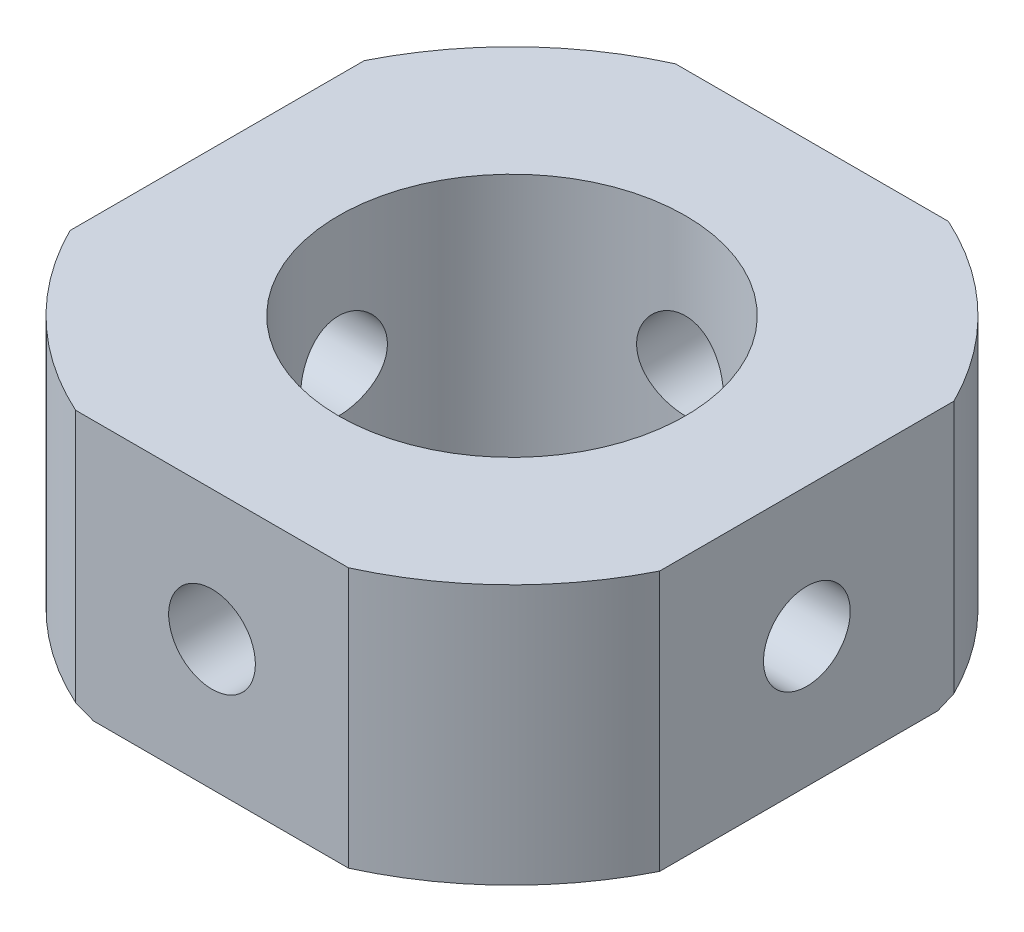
ISO-10303-21;
HEADER;
FILE_DESCRIPTION(('STEP AP214'),'2;1');
FILE_NAME('part.step','',(''),(''),'','','');
FILE_SCHEMA(('AUTOMOTIVE_DESIGN { 1 0 10303 214 1 1 1 1 }'));
ENDSEC;
DATA;
#1=APPLICATION_CONTEXT('core data for automotive mechanical design processes');
#2=APPLICATION_PROTOCOL_DEFINITION('international standard','automotive_design',2000,#1);
#3=PRODUCT_CONTEXT('',#1,'mechanical');
#4=PRODUCT('Part','Part','',(#3));
#5=PRODUCT_RELATED_PRODUCT_CATEGORY('part','',(#4));
#6=PRODUCT_DEFINITION_FORMATION('','',#4);
#7=PRODUCT_DEFINITION_CONTEXT('part definition',#1,'design');
#8=PRODUCT_DEFINITION('design','',#6,#7);
#9=PRODUCT_DEFINITION_SHAPE('','',#8);
#10=(LENGTH_UNIT() NAMED_UNIT(*) SI_UNIT(.MILLI.,.METRE.));
#11=(NAMED_UNIT(*) PLANE_ANGLE_UNIT() SI_UNIT($,.RADIAN.));
#12=(NAMED_UNIT(*) SI_UNIT($,.STERADIAN.) SOLID_ANGLE_UNIT());
#13=UNCERTAINTY_MEASURE_WITH_UNIT(LENGTH_MEASURE(1.E-05),#10,'distance_accuracy_value','');
#14=(GEOMETRIC_REPRESENTATION_CONTEXT(3) GLOBAL_UNCERTAINTY_ASSIGNED_CONTEXT((#13)) GLOBAL_UNIT_ASSIGNED_CONTEXT((#10,
#11,#12)) REPRESENTATION_CONTEXT('',''));
#15=CARTESIAN_POINT('',(0.,0.,0.));
#16=DIRECTION('',(0.,0.,1.));
#17=DIRECTION('',(1.,0.,0.));
#18=AXIS2_PLACEMENT_3D('',#15,#16,#17);
#19=CARTESIAN_POINT('',(-8.5,-3.75,-8.64766599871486));
#20=DIRECTION('',(0.,0.,-1.));
#21=DIRECTION('',(-1.,0.,0.));
#22=AXIS2_PLACEMENT_3D('',#19,#20,#21);
#23=PLANE('',#22);
#24=DIRECTION('',(0.,-1.,0.));
#25=VECTOR('',#24,1.);
#26=CARTESIAN_POINT('',(3.93292165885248,3.75,-8.64766599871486));
#27=LINE('',#26,#25);
#28=CARTESIAN_POINT('',(3.93292165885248,3.75,-8.64766599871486));
#29=VERTEX_POINT('',#28);
#30=CARTESIAN_POINT('',(3.93292165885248,-3.55,-8.64766599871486));
#31=VERTEX_POINT('',#30);
#32=EDGE_CURVE('E125',#29,#31,#27,.T.);
#33=ORIENTED_EDGE('',*,*,#32,.T.);
#34=CARTESIAN_POINT('',(3.93292165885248,-3.55,-8.64766599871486));
#35=CARTESIAN_POINT('',(3.84838019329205,-3.58503549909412,-8.64766599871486));
#36=CARTESIAN_POINT('',(3.76350577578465,-3.61921989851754,-8.64766599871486));
#37=CARTESIAN_POINT('',(3.59309085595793,-3.68588656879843,-8.64766599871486));
#38=CARTESIAN_POINT('',(3.50755035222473,-3.71836883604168,-8.64766599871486));
#39=CARTESIAN_POINT('',(3.42167689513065,-3.75,-8.64766599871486));
#40=B_SPLINE_CURVE_WITH_KNOTS('',3,(#34,#35,#36,#37,#38,#39),.UNSPECIFIED.,.F.,.F.,(4,2,4),(0.,
0.27449983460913,0.549000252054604),.UNSPECIFIED.);
#41=CARTESIAN_POINT('',(3.42167689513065,-3.75,-8.64766599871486));
#42=VERTEX_POINT('',#41);
#43=EDGE_CURVE('E280',#31,#42,#40,.T.);
#44=ORIENTED_EDGE('',*,*,#43,.T.);
#45=DIRECTION('',(-1.,0.,0.));
#46=VECTOR('',#45,1.);
#47=CARTESIAN_POINT('',(0.,-3.75,-8.64766599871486));
#48=LINE('',#47,#46);
#49=CARTESIAN_POINT('',(-3.93292165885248,-3.75,-8.64766599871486));
#50=VERTEX_POINT('',#49);
#51=EDGE_CURVE('E151',#42,#50,#48,.T.);
#52=ORIENTED_EDGE('',*,*,#51,.T.);
#53=DIRECTION('',(0.,-1.,0.));
#54=VECTOR('',#53,1.);
#55=CARTESIAN_POINT('',(-3.93292165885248,3.75,-8.64766599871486));
#56=LINE('',#55,#54);
#57=CARTESIAN_POINT('',(-3.93292165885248,3.75,-8.64766599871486));
#58=VERTEX_POINT('',#57);
#59=EDGE_CURVE('E127',#50,#58,#56,.F.);
#60=ORIENTED_EDGE('',*,*,#59,.T.);
#61=DIRECTION('',(-1.,0.,0.));
#62=VECTOR('',#61,1.);
#63=CARTESIAN_POINT('',(-8.5,3.75,-8.64766599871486));
#64=LINE('',#63,#62);
#65=EDGE_CURVE('E122',#29,#58,#64,.T.);
#66=ORIENTED_EDGE('',*,*,#65,.F.);
#67=EDGE_LOOP('',(#33,#44,#52,#60,#66));
#68=FACE_BOUND('',#67,.T.);
#69=CARTESIAN_POINT('',(0.,0.,-8.64766599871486));
#70=DIRECTION('',(0.,0.,1.));
#71=DIRECTION('',(1.,0.,0.));
#72=AXIS2_PLACEMENT_3D('',#69,#70,#71);
#73=CIRCLE('',#72,1.25);
#74=CARTESIAN_POINT('',(1.25,0.,-8.64766599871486));
#75=VERTEX_POINT('',#74);
#76=EDGE_CURVE('E217',#75,#75,#73,.T.);
#77=ORIENTED_EDGE('',*,*,#76,.T.);
#78=EDGE_LOOP('',(#77));
#79=FACE_BOUND('',#78,.T.);
#80=ADVANCED_FACE('F39',(#68,#79),#23,.T.);
#81=CARTESIAN_POINT('',(0.,3.75,0.));
#82=DIRECTION('',(0.,-1.,0.));
#83=DIRECTION('',(0.,0.,-1.));
#84=AXIS2_PLACEMENT_3D('',#81,#82,#83);
#85=CYLINDRICAL_SURFACE('',#84,9.5);
#86=DIRECTION('',(0.,-1.,0.));
#87=VECTOR('',#86,1.);
#88=CARTESIAN_POINT('',(8.5,3.75,4.24264068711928));
#89=LINE('',#88,#87);
#90=CARTESIAN_POINT('',(8.5,3.75,4.24264068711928));
#91=VERTEX_POINT('',#90);
#92=CARTESIAN_POINT('',(8.5,-3.75,4.24264068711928));
#93=VERTEX_POINT('',#92);
#94=EDGE_CURVE('E250',#91,#93,#89,.T.);
#95=ORIENTED_EDGE('',*,*,#94,.F.);
#96=CARTESIAN_POINT('',(0.,3.75,0.));
#97=DIRECTION('',(0.,1.,0.));
#98=DIRECTION('',(0.,0.,1.));
#99=AXIS2_PLACEMENT_3D('',#96,#97,#98);
#100=CIRCLE('',#99,9.5);
#101=CARTESIAN_POINT('',(3.93292165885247,3.75,8.64766599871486));
#102=VERTEX_POINT('',#101);
#103=EDGE_CURVE('E148',#102,#91,#100,.T.);
#104=ORIENTED_EDGE('',*,*,#103,.F.);
#105=DIRECTION('',(0.,-1.,0.));
#106=VECTOR('',#105,1.);
#107=CARTESIAN_POINT('',(3.93292165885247,3.75,8.64766599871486));
#108=LINE('',#107,#106);
#109=CARTESIAN_POINT('',(3.93292165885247,-3.75,8.64766599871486));
#110=VERTEX_POINT('',#109);
#111=EDGE_CURVE('E243',#110,#102,#108,.F.);
#112=ORIENTED_EDGE('',*,*,#111,.F.);
#113=CARTESIAN_POINT('',(0.,-3.75,0.));
#114=DIRECTION('',(0.,1.,0.));
#115=DIRECTION('',(0.,0.,1.));
#116=AXIS2_PLACEMENT_3D('',#113,#114,#115);
#117=CIRCLE('',#116,9.5);
#118=EDGE_CURVE('E157',#110,#93,#117,.T.);
#119=ORIENTED_EDGE('',*,*,#118,.T.);
#120=EDGE_LOOP('',(#95,#104,#112,#119));
#121=FACE_BOUND('',#120,.T.);
#122=ADVANCED_FACE('F271',(#121),#85,.T.);
#123=DIRECTION('',(0.,-1.,0.));
#124=VECTOR('',#123,1.);
#125=CARTESIAN_POINT('',(8.5,3.75,-4.24264068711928));
#126=LINE('',#125,#124);
#127=CARTESIAN_POINT('',(8.5,-3.55,-4.24264068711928));
#128=VERTEX_POINT('',#127);
#129=CARTESIAN_POINT('',(8.5,3.75,-4.24264068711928));
#130=VERTEX_POINT('',#129);
#131=EDGE_CURVE('E248',#128,#130,#126,.F.);
#132=ORIENTED_EDGE('',*,*,#131,.F.);
#133=CARTESIAN_POINT('',(0.,-3.55,0.));
#134=DIRECTION('',(0.,1.,0.));
#135=DIRECTION('',(0.,0.,1.));
#136=AXIS2_PLACEMENT_3D('',#133,#134,#135);
#137=CIRCLE('',#136,9.5);
#138=EDGE_CURVE('E142',#128,#31,#137,.T.);
#139=ORIENTED_EDGE('',*,*,#138,.T.);
#140=ORIENTED_EDGE('',*,*,#32,.F.);
#141=EDGE_CURVE('E140',#130,#29,#100,.T.);
#142=ORIENTED_EDGE('',*,*,#141,.F.);
#143=EDGE_LOOP('',(#132,#139,#140,#142));
#144=FACE_BOUND('',#143,.T.);
#145=ADVANCED_FACE('F139',(#144),#85,.T.);
#146=DIRECTION('',(0.,-1.,0.));
#147=VECTOR('',#146,1.);
#148=CARTESIAN_POINT('',(-8.5,3.75,4.24264068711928));
#149=LINE('',#148,#147);
#150=CARTESIAN_POINT('',(-8.5,-3.55,4.24264068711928));
#151=VERTEX_POINT('',#150);
#152=CARTESIAN_POINT('',(-8.5,3.75,4.24264068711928));
#153=VERTEX_POINT('',#152);
#154=EDGE_CURVE('E143',#151,#153,#149,.F.);
#155=ORIENTED_EDGE('',*,*,#154,.F.);
#156=CARTESIAN_POINT('',(0.,-3.55,0.));
#157=DIRECTION('',(0.,1.,0.));
#158=DIRECTION('',(0.,0.,1.));
#159=AXIS2_PLACEMENT_3D('',#156,#157,#158);
#160=CIRCLE('',#159,9.5);
#161=CARTESIAN_POINT('',(-3.93292165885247,-3.55,8.64766599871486));
#162=VERTEX_POINT('',#161);
#163=EDGE_CURVE('E208',#151,#162,#160,.T.);
#164=ORIENTED_EDGE('',*,*,#163,.T.);
#165=DIRECTION('',(0.,-1.,0.));
#166=VECTOR('',#165,1.);
#167=CARTESIAN_POINT('',(-3.93292165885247,3.75,8.64766599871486));
#168=LINE('',#167,#166);
#169=CARTESIAN_POINT('',(-3.93292165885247,3.75,8.64766599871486));
#170=VERTEX_POINT('',#169);
#171=EDGE_CURVE('E245',#170,#162,#168,.T.);
#172=ORIENTED_EDGE('',*,*,#171,.F.);
#173=EDGE_CURVE('E152',#153,#170,#100,.T.);
#174=ORIENTED_EDGE('',*,*,#173,.F.);
#175=EDGE_LOOP('',(#155,#164,#172,#174));
#176=FACE_BOUND('',#175,.T.);
#177=ADVANCED_FACE('F268',(#176),#85,.T.);
#178=DIRECTION('',(0.,-1.,0.));
#179=VECTOR('',#178,1.);
#180=CARTESIAN_POINT('',(-8.5,3.75,-4.24264068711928));
#181=LINE('',#180,#179);
#182=CARTESIAN_POINT('',(-8.5,3.75,-4.24264068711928));
#183=VERTEX_POINT('',#182);
#184=CARTESIAN_POINT('',(-8.5,-3.75,-4.24264068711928));
#185=VERTEX_POINT('',#184);
#186=EDGE_CURVE('E241',#183,#185,#181,.T.);
#187=ORIENTED_EDGE('',*,*,#186,.F.);
#188=EDGE_CURVE('E149',#58,#183,#100,.T.);
#189=ORIENTED_EDGE('',*,*,#188,.F.);
#190=ORIENTED_EDGE('',*,*,#59,.F.);
#191=EDGE_CURVE('E160',#50,#185,#117,.T.);
#192=ORIENTED_EDGE('',*,*,#191,.T.);
#193=EDGE_LOOP('',(#187,#189,#190,#192));
#194=FACE_BOUND('',#193,.T.);
#195=ADVANCED_FACE('F262',(#194),#85,.T.);
#196=CARTESIAN_POINT('',(0.,3.75,0.));
#197=DIRECTION('',(0.,1.,0.));
#198=DIRECTION('',(0.,0.,1.));
#199=AXIS2_PLACEMENT_3D('',#196,#197,#198);
#200=PLANE('',#199);
#201=CARTESIAN_POINT('',(0.,3.75,0.));
#202=DIRECTION('',(0.,1.,0.));
#203=DIRECTION('',(0.,0.,1.));
#204=AXIS2_PLACEMENT_3D('',#201,#202,#203);
#205=CIRCLE('',#204,5.);
#206=CARTESIAN_POINT('',(0.,3.75,5.));
#207=VERTEX_POINT('',#206);
#208=EDGE_CURVE('E155',#207,#207,#205,.T.);
#209=ORIENTED_EDGE('',*,*,#208,.F.);
#210=EDGE_LOOP('',(#209));
#211=FACE_BOUND('',#210,.T.);
#212=ORIENTED_EDGE('',*,*,#103,.T.);
#213=DIRECTION('',(0.,0.,-1.));
#214=VECTOR('',#213,1.);
#215=CARTESIAN_POINT('',(8.5,3.75,8.64766599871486));
#216=LINE('',#215,#214);
#217=EDGE_CURVE('E133',#91,#130,#216,.T.);
#218=ORIENTED_EDGE('',*,*,#217,.T.);
#219=ORIENTED_EDGE('',*,*,#141,.T.);
#220=ORIENTED_EDGE('',*,*,#65,.T.);
#221=ORIENTED_EDGE('',*,*,#188,.T.);
#222=DIRECTION('',(0.,0.,1.));
#223=VECTOR('',#222,1.);
#224=CARTESIAN_POINT('',(-8.5,3.75,8.64766599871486));
#225=LINE('',#224,#223);
#226=EDGE_CURVE('E132',#183,#153,#225,.T.);
#227=ORIENTED_EDGE('',*,*,#226,.T.);
#228=ORIENTED_EDGE('',*,*,#173,.T.);
#229=DIRECTION('',(1.,0.,0.));
#230=VECTOR('',#229,1.);
#231=CARTESIAN_POINT('',(-8.5,3.75,8.64766599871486));
#232=LINE('',#231,#230);
#233=EDGE_CURVE('E236',#170,#102,#232,.T.);
#234=ORIENTED_EDGE('',*,*,#233,.T.);
#235=EDGE_LOOP('',(#212,#218,#219,#220,#221,#227,#228,#234));
#236=FACE_BOUND('',#235,.T.);
#237=ADVANCED_FACE('F147',(#211,#236),#200,.T.);
#238=CARTESIAN_POINT('',(0.,-3.75,0.));
#239=DIRECTION('',(0.,1.,0.));
#240=DIRECTION('',(0.,0.,1.));
#241=AXIS2_PLACEMENT_3D('',#238,#239,#240);
#242=PLANE('',#241);
#243=CARTESIAN_POINT('',(0.,-3.75,0.));
#244=DIRECTION('',(0.,1.,0.));
#245=DIRECTION('',(0.,0.,1.));
#246=AXIS2_PLACEMENT_3D('',#243,#244,#245);
#247=CIRCLE('',#246,5.);
#248=CARTESIAN_POINT('',(0.,-3.75,5.));
#249=VERTEX_POINT('',#248);
#250=EDGE_CURVE('E251',#249,#249,#247,.T.);
#251=ORIENTED_EDGE('',*,*,#250,.T.);
#252=EDGE_LOOP('',(#251));
#253=FACE_BOUND('',#252,.T.);
#254=ORIENTED_EDGE('',*,*,#51,.F.);
#255=CARTESIAN_POINT('',(0.,-3.75,0.));
#256=DIRECTION('',(0.,1.,0.));
#257=DIRECTION('',(0.,0.,1.));
#258=AXIS2_PLACEMENT_3D('',#255,#256,#257);
#259=CIRCLE('',#258,9.3);
#260=CARTESIAN_POINT('',(8.5,-3.75,-3.77359245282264));
#261=VERTEX_POINT('',#260);
#262=EDGE_CURVE('E295',#42,#261,#259,.F.);
#263=ORIENTED_EDGE('',*,*,#262,.T.);
#264=DIRECTION('',(0.,0.,-1.));
#265=VECTOR('',#264,1.);
#266=CARTESIAN_POINT('',(8.5,-3.75,0.));
#267=LINE('',#266,#265);
#268=EDGE_CURVE('E166',#93,#261,#267,.T.);
#269=ORIENTED_EDGE('',*,*,#268,.F.);
#270=ORIENTED_EDGE('',*,*,#118,.F.);
#271=DIRECTION('',(1.,0.,0.));
#272=VECTOR('',#271,1.);
#273=CARTESIAN_POINT('',(0.,-3.75,8.64766599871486));
#274=LINE('',#273,#272);
#275=CARTESIAN_POINT('',(-3.42167689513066,-3.75,8.64766599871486));
#276=VERTEX_POINT('',#275);
#277=EDGE_CURVE('E164',#276,#110,#274,.T.);
#278=ORIENTED_EDGE('',*,*,#277,.F.);
#279=CARTESIAN_POINT('',(0.,-3.75,0.));
#280=DIRECTION('',(0.,1.,0.));
#281=DIRECTION('',(0.,0.,1.));
#282=AXIS2_PLACEMENT_3D('',#279,#280,#281);
#283=CIRCLE('',#282,9.3);
#284=CARTESIAN_POINT('',(-8.5,-3.75,3.77359245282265));
#285=VERTEX_POINT('',#284);
#286=EDGE_CURVE('E285',#276,#285,#283,.F.);
#287=ORIENTED_EDGE('',*,*,#286,.T.);
#288=DIRECTION('',(0.,0.,1.));
#289=VECTOR('',#288,1.);
#290=CARTESIAN_POINT('',(-8.5,-3.75,0.));
#291=LINE('',#290,#289);
#292=EDGE_CURVE('E162',#185,#285,#291,.T.);
#293=ORIENTED_EDGE('',*,*,#292,.F.);
#294=ORIENTED_EDGE('',*,*,#191,.F.);
#295=EDGE_LOOP('',(#254,#263,#269,#270,#278,#287,#293,#294));
#296=FACE_BOUND('',#295,.T.);
#297=ADVANCED_FACE('F261',(#253,#296),#242,.F.);
#298=CARTESIAN_POINT('',(0.,-3.75,0.));
#299=DIRECTION('',(0.,1.,0.));
#300=DIRECTION('',(0.,0.,1.));
#301=AXIS2_PLACEMENT_3D('',#298,#299,#300);
#302=CYLINDRICAL_SURFACE('',#301,5.);
#303=CARTESIAN_POINT('',(0.,-1.24999999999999,5.));
#304=CARTESIAN_POINT('',(0.0690634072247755,-1.24999806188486,4.99999883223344));
#305=CARTESIAN_POINT('',(0.138148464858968,-1.24425704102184,4.99855481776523));
#306=CARTESIAN_POINT('',(0.274338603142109,-1.22147904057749,4.99293428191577));
#307=CARTESIAN_POINT('',(0.341442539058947,-1.20443565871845,4.98875621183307));
#308=CARTESIAN_POINT('',(0.471684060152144,-1.15963395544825,4.97813021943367));
#309=CARTESIAN_POINT('',(0.534826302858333,-1.13188850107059,4.97168502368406));
#310=CARTESIAN_POINT('',(0.655560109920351,-1.06651550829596,4.95721119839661));
#311=CARTESIAN_POINT('',(0.713151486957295,-1.02888763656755,4.94918251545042));
#312=CARTESIAN_POINT('',(0.822334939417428,-0.943999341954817,4.93222844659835));
#313=CARTESIAN_POINT('',(0.873796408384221,-0.896573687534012,4.92328922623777));
#314=CARTESIAN_POINT('',(0.968124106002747,-0.793789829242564,4.90561350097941));
#315=CARTESIAN_POINT('',(1.01098936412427,-0.738430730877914,4.89687701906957));
#316=CARTESIAN_POINT('',(1.08752211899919,-0.620337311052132,4.88045646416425));
#317=CARTESIAN_POINT('',(1.12104351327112,-0.557505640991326,4.87278995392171));
#318=CARTESIAN_POINT('',(1.1769974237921,-0.42687632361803,4.85957912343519));
#319=CARTESIAN_POINT('',(1.1994317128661,-0.35907947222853,4.85403446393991));
#320=CARTESIAN_POINT('',(1.23212903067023,-0.221880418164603,4.84583730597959));
#321=CARTESIAN_POINT('',(1.24262689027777,-0.152537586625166,4.84312909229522));
#322=CARTESIAN_POINT('',(1.25188481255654,-0.0130261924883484,4.84074468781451));
#323=CARTESIAN_POINT('',(1.25064678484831,0.057142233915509,4.8410680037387));
#324=CARTESIAN_POINT('',(1.23665543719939,0.1945131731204,4.84466004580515));
#325=CARTESIAN_POINT('',(1.22418195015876,0.261746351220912,4.84785719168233));
#326=CARTESIAN_POINT('',(1.18852015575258,0.393134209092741,4.85672258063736));
#327=CARTESIAN_POINT('',(1.16533108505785,0.457288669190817,4.8623909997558));
#328=CARTESIAN_POINT('',(1.10865789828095,0.581448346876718,4.87562594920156));
#329=CARTESIAN_POINT('',(1.07507222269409,0.641405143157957,4.88321106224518));
#330=CARTESIAN_POINT('',(0.998630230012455,0.754932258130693,4.89941425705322));
#331=CARTESIAN_POINT('',(0.955772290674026,0.808501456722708,4.90803251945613));
#332=CARTESIAN_POINT('',(0.860552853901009,0.909336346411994,4.92563233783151));
#333=CARTESIAN_POINT('',(0.807955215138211,0.956378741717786,4.93461724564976));
#334=CARTESIAN_POINT('',(0.695509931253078,1.04101770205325,4.95171637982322));
#335=CARTESIAN_POINT('',(0.635662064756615,1.07861397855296,4.95983057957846));
#336=CARTESIAN_POINT('',(0.510096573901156,1.14337548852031,4.97431443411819));
#337=CARTESIAN_POINT('',(0.444359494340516,1.17050445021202,4.98067800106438));
#338=CARTESIAN_POINT('',(0.309063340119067,1.21326442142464,4.99089930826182));
#339=CARTESIAN_POINT('',(0.239504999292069,1.22889763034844,4.99475752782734));
#340=CARTESIAN_POINT('',(0.100449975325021,1.24788130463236,4.99946249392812));
#341=CARTESIAN_POINT('',(0.0309972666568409,1.25153585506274,5.00038377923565));
#342=CARTESIAN_POINT('',(-0.107527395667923,1.24729249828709,4.99932337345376));
#343=CARTESIAN_POINT('',(-0.176599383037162,1.23939563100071,4.99734194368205));
#344=CARTESIAN_POINT('',(-0.311345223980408,1.21252424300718,4.99074650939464));
#345=CARTESIAN_POINT('',(-0.377054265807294,1.19371561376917,4.98617195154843));
#346=CARTESIAN_POINT('',(-0.504381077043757,1.14574409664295,4.97490588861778));
#347=CARTESIAN_POINT('',(-0.565998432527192,1.11658016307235,4.9682141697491));
#348=CARTESIAN_POINT('',(-0.684602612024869,1.04813655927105,4.95327756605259));
#349=CARTESIAN_POINT('',(-0.741487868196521,1.00868657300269,4.94500722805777));
#350=CARTESIAN_POINT('',(-0.8479388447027,0.921008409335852,4.92787090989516));
#351=CARTESIAN_POINT('',(-0.897503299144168,0.872778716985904,4.91900482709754));
#352=CARTESIAN_POINT('',(-0.98915880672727,0.767498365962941,4.90140797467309));
#353=CARTESIAN_POINT('',(-1.03103655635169,0.710260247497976,4.89268586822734));
#354=CARTESIAN_POINT('',(-1.10459229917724,0.589389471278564,4.87660731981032));
#355=CARTESIAN_POINT('',(-1.13627074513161,0.525757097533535,4.86925081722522));
#356=CARTESIAN_POINT('',(-1.18829285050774,0.394245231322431,4.85681745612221));
#357=CARTESIAN_POINT('',(-1.20870366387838,0.326393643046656,4.85172712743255));
#358=CARTESIAN_POINT('',(-1.23778804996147,0.188075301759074,4.84438953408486));
#359=CARTESIAN_POINT('',(-1.24646418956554,0.11760912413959,4.84214164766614));
#360=CARTESIAN_POINT('',(-1.25169882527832,-0.0217675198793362,4.84079084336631));
#361=CARTESIAN_POINT('',(-1.24859824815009,-0.0906645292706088,4.8415994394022));
#362=CARTESIAN_POINT('',(-1.23114773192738,-0.226919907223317,4.84606590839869));
#363=CARTESIAN_POINT('',(-1.21679801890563,-0.294278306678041,4.84972372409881));
#364=CARTESIAN_POINT('',(-1.17744276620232,-0.425173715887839,4.85942717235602));
#365=CARTESIAN_POINT('',(-1.15250117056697,-0.488731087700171,4.86545846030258));
#366=CARTESIAN_POINT('',(-1.09272076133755,-0.610804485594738,4.87923129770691));
#367=CARTESIAN_POINT('',(-1.05788057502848,-0.669319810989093,4.88697308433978));
#368=CARTESIAN_POINT('',(-0.978223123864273,-0.781295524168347,4.90354695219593));
#369=CARTESIAN_POINT('',(-0.933169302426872,-0.834584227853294,4.91240220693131));
#370=CARTESIAN_POINT('',(-0.83482447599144,-0.932955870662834,4.93006689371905));
#371=CARTESIAN_POINT('',(-0.781531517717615,-0.978036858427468,4.93887631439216));
#372=CARTESIAN_POINT('',(-0.667056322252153,-1.05950942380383,4.95564713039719));
#373=CARTESIAN_POINT('',(-0.605748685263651,-1.09572884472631,4.9635902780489));
#374=CARTESIAN_POINT('',(-0.477721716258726,-1.15728955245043,4.97754104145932));
#375=CARTESIAN_POINT('',(-0.411006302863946,-1.18263863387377,4.98355004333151));
#376=CARTESIAN_POINT('',(-0.287008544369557,-1.2179765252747,4.99206716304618));
#377=CARTESIAN_POINT('',(-0.230316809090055,-1.22995936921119,4.99502154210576));
#378=CARTESIAN_POINT('',(-0.115755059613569,-1.24597161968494,4.9989883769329));
#379=CARTESIAN_POINT('',(-0.0578851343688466,-1.25000162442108,5.00000097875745));
#380=CARTESIAN_POINT('',(0.,-1.24999999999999,5.));
#381=B_SPLINE_CURVE_WITH_KNOTS('',3,(#303,#304,#305,#306,#307,#308,#309,#310,#311,#312,#313,
#314,#315,#316,#317,#318,#319,#320,#321,#322,#323,#324,#325,#326,#327,#328,#329,#330,#331,#332,
#333,#334,#335,#336,#337,#338,#339,#340,#341,#342,#343,#344,#345,#346,#347,#348,#349,#350,#351,
#352,#353,#354,#355,#356,#357,#358,#359,#360,#361,#362,#363,#364,#365,#366,#367,#368,#369,#370,
#371,#372,#373,#374,#375,#376,#377,#378,#379,#380),.UNSPECIFIED.,.T.,.F.,(4,2,2,2,2,2,2,2,2,2,2,
2,2,2,2,2,2,2,2,2,2,2,2,2,2,2,2,2,2,2,2,2,2,2,2,2,2,2,4),(0.,0.206978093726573,
0.414073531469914,0.620920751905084,0.827774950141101,1.03845362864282,1.24915607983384,
1.46298872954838,1.67678717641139,1.88630245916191,2.09578365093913,2.30018747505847,
2.50460586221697,2.71108773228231,2.917605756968,3.13001250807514,3.3424257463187,
3.55556857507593,3.768670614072,3.97631924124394,4.1839491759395,4.38850228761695,
4.59307606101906,4.8012798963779,5.00951969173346,5.22287091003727,5.43621265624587,
5.64826878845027,5.86027852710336,6.0661981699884,6.27211367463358,6.47680333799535,
6.6815214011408,6.89157980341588,7.1016880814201,7.31560154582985,7.52936136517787,
7.70285202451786,7.87632963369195),.UNSPECIFIED.);
#382=CARTESIAN_POINT('',(0.,-1.24999999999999,5.));
#383=VERTEX_POINT('',#382);
#384=EDGE_CURVE('E44',#383,#383,#381,.T.);
#385=ORIENTED_EDGE('',*,*,#384,.T.);
#386=EDGE_LOOP('',(#385));
#387=FACE_BOUND('',#386,.T.);
#388=CARTESIAN_POINT('',(1.24999999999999,0.,-4.84122918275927));
#389=CARTESIAN_POINT('',(1.24999803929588,-0.0690253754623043,-4.84123050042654));
#390=CARTESIAN_POINT('',(1.24426312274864,-0.138072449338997,-4.84272153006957));
#391=CARTESIAN_POINT('',(1.22151156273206,-0.274183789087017,-4.84850930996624));
#392=CARTESIAN_POINT('',(1.20448835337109,-0.341246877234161,-4.85280769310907));
#393=CARTESIAN_POINT('',(1.15974559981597,-0.471401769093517,-4.86369362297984));
#394=CARTESIAN_POINT('',(1.13203986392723,-0.534498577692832,-4.87027821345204));
#395=CARTESIAN_POINT('',(1.0667605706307,-0.655155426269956,-4.88499096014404));
#396=CARTESIAN_POINT('',(1.02918659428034,-0.712715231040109,-4.89311918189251));
#397=CARTESIAN_POINT('',(0.944354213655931,-0.821930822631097,-4.91020358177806));
#398=CARTESIAN_POINT('',(0.896918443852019,-0.873446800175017,-4.91917298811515));
#399=CARTESIAN_POINT('',(0.794091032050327,-0.967880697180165,-4.93681437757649));
#400=CARTESIAN_POINT('',(0.738698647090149,-1.01079781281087,-4.94548633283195));
#401=CARTESIAN_POINT('',(0.620572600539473,-1.08738773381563,-4.96170207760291));
#402=CARTESIAN_POINT('',(0.557747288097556,-1.12092319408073,-4.96922843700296));
#403=CARTESIAN_POINT('',(0.427131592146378,-1.17690482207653,-4.98215405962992));
#404=CARTESIAN_POINT('',(0.359341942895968,-1.19935262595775,-4.98755363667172));
#405=CARTESIAN_POINT('',(0.222179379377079,-1.23207391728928,-4.9955237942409));
#406=CARTESIAN_POINT('',(0.152866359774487,-1.24258482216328,-4.99814946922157));
#407=CARTESIAN_POINT('',(0.0134144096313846,-1.25187918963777,-5.00046797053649));
#408=CARTESIAN_POINT('',(-0.0567243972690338,-1.25066438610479,-5.00016123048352));
#409=CARTESIAN_POINT('',(-0.194190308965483,-1.23671257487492,-4.99669047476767));
#410=CARTESIAN_POINT('',(-0.261545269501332,-1.22423183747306,-4.99359001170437));
#411=CARTESIAN_POINT('',(-0.393172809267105,-1.18851436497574,-4.98495418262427));
#412=CARTESIAN_POINT('',(-0.457445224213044,-1.16527705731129,-4.9794186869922));
#413=CARTESIAN_POINT('',(-0.581758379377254,-1.10849871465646,-4.96643754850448));
#414=CARTESIAN_POINT('',(-0.641755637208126,-1.07486647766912,-4.95897509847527));
#415=CARTESIAN_POINT('',(-0.755344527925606,-0.998322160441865,-4.94294951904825));
#416=CARTESIAN_POINT('',(-0.808935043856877,-0.955408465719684,-4.93438619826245));
#417=CARTESIAN_POINT('',(-0.909717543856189,-0.860145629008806,-4.9168185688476));
#418=CARTESIAN_POINT('',(-0.956697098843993,-0.807572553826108,-4.90780859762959));
#419=CARTESIAN_POINT('',(-1.04122046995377,-0.695200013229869,-4.89057521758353));
#420=CARTESIAN_POINT('',(-1.07876384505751,-0.635400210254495,-4.88235184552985));
#421=CARTESIAN_POINT('',(-1.14348516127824,-0.509854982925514,-4.86760248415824));
#422=CARTESIAN_POINT('',(-1.17061195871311,-0.444082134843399,-4.8610849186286));
#423=CARTESIAN_POINT('',(-1.21335702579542,-0.308707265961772,-4.85059320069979));
#424=CARTESIAN_POINT('',(-1.22897775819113,-0.239106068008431,-4.84661850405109));
#425=CARTESIAN_POINT('',(-1.24791481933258,-0.100020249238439,-4.84177678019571));
#426=CARTESIAN_POINT('',(-1.25154523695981,-0.0305811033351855,-4.84083044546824));
#427=CARTESIAN_POINT('',(-1.24725849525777,0.107910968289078,-4.8419367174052));
#428=CARTESIAN_POINT('',(-1.23934239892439,0.176963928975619,-4.84398904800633));
#429=CARTESIAN_POINT('',(-1.21246273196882,0.311557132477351,-4.8507854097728));
#430=CARTESIAN_POINT('',(-1.19368203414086,0.377136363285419,-4.85548485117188));
#431=CARTESIAN_POINT('',(-1.1458090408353,0.504215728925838,-4.86700359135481));
#432=CARTESIAN_POINT('',(-1.11671552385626,0.565715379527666,-4.87382314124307));
#433=CARTESIAN_POINT('',(-1.04838533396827,0.68422063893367,-4.88898068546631));
#434=CARTESIAN_POINT('',(-1.00896087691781,0.741114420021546,-4.89734584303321));
#435=CARTESIAN_POINT('',(-0.921325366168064,0.847594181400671,-4.91458541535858));
#436=CARTESIAN_POINT('',(-0.873112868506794,0.897178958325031,-4.92345991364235));
#437=CARTESIAN_POINT('',(-0.767828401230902,0.988905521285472,-4.94098701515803));
#438=CARTESIAN_POINT('',(-0.710564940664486,1.0308300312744,-4.94962851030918));
#439=CARTESIAN_POINT('',(-0.58962835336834,1.10446793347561,-4.96548608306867));
#440=CARTESIAN_POINT('',(-0.525955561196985,1.1361818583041,-4.9727022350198));
#441=CARTESIAN_POINT('',(-0.39444775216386,1.18822301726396,-4.98485057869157));
#442=CARTESIAN_POINT('',(-0.326646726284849,1.20863214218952,-4.98979915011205));
#443=CARTESIAN_POINT('',(-0.188437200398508,1.2377301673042,-4.99692646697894));
#444=CARTESIAN_POINT('',(-0.118029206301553,1.24642132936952,-4.99910574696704));
#445=CARTESIAN_POINT('',(0.0213544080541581,1.25170948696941,-5.00042711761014));
#446=CARTESIAN_POINT('',(0.090317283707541,1.24862713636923,-4.9996497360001));
#447=CARTESIAN_POINT('',(0.226709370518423,1.23119021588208,-4.9953237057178));
#448=CARTESIAN_POINT('',(0.294138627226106,1.21683598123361,-4.99177513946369));
#449=CARTESIAN_POINT('',(0.425213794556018,1.17743472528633,-4.98231791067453));
#450=CARTESIAN_POINT('',(0.488878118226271,1.15244568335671,-4.97642205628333));
#451=CARTESIAN_POINT('',(0.611146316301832,1.09253677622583,-4.9628911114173));
#452=CARTESIAN_POINT('',(0.66974955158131,1.05761565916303,-4.9552558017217));
#453=CARTESIAN_POINT('',(0.78175241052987,0.977855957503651,-4.93884062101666));
#454=CARTESIAN_POINT('',(0.834993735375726,0.932799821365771,-4.93003771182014));
#455=CARTESIAN_POINT('',(0.933268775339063,0.834471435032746,-4.91238311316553));
#456=CARTESIAN_POINT('',(0.978300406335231,0.781197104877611,-4.90353141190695));
#457=CARTESIAN_POINT('',(1.05970253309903,0.666748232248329,-4.88659344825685));
#458=CARTESIAN_POINT('',(1.09589577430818,0.605444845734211,-4.87852454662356));
#459=CARTESIAN_POINT('',(1.15740862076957,0.47743063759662,-4.8642994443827));
#460=CARTESIAN_POINT('',(1.18273613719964,0.410723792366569,-4.85814185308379));
#461=CARTESIAN_POINT('',(1.21802816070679,0.286778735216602,-4.84939885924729));
#462=CARTESIAN_POINT('',(1.22999146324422,0.230133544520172,-4.84635828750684));
#463=CARTESIAN_POINT('',(1.24597786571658,0.115663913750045,-4.84227298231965));
#464=CARTESIAN_POINT('',(1.25000164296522,0.0578395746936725,-4.84122807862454));
#465=CARTESIAN_POINT('',(1.24999999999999,0.,-4.84122918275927));
#466=B_SPLINE_CURVE_WITH_KNOTS('',3,(#388,#389,#390,#391,#392,#393,#394,#395,#396,#397,#398,
#399,#400,#401,#402,#403,#404,#405,#406,#407,#408,#409,#410,#411,#412,#413,#414,#415,#416,#417,
#418,#419,#420,#421,#422,#423,#424,#425,#426,#427,#428,#429,#430,#431,#432,#433,#434,#435,#436,
#437,#438,#439,#440,#441,#442,#443,#444,#445,#446,#447,#448,#449,#450,#451,#452,#453,#454,#455,
#456,#457,#458,#459,#460,#461,#462,#463,#464,#465),.UNSPECIFIED.,.T.,.F.,(4,2,2,2,2,2,2,2,2,2,2,
2,2,2,2,2,2,2,2,2,2,2,2,2,2,2,2,2,2,2,2,2,2,2,2,2,2,2,4),(0.,0.206863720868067,0.41384787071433,
0.620565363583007,0.827291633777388,1.03811977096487,1.24896760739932,1.46275748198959,
1.67651579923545,1.88594375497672,2.09534074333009,2.30009131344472,2.50485278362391,
2.7114643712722,2.91811192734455,3.13035233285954,3.34260265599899,3.55588216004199,
3.76911600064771,3.97671787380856,4.18430063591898,4.38848702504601,4.59269760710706,
4.80091422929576,5.00916509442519,5.22262665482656,5.43607707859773,5.64796036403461,
5.85980274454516,6.06591723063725,6.27202558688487,6.47702438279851,6.68204902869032,
6.89198548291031,7.1019751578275,7.31588238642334,7.52963360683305,7.7029891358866,
7.87632987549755),.UNSPECIFIED.);
#467=CARTESIAN_POINT('',(1.24999999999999,0.,-4.84122918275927));
#468=VERTEX_POINT('',#467);
#469=EDGE_CURVE('E213',#468,#468,#466,.T.);
#470=ORIENTED_EDGE('',*,*,#469,.T.);
#471=EDGE_LOOP('',(#470));
#472=FACE_BOUND('',#471,.T.);
#473=CARTESIAN_POINT('',(-4.84122918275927,0.,-1.24999999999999));
#474=CARTESIAN_POINT('',(-4.84123050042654,-0.0690253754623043,-1.24999803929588));
#475=CARTESIAN_POINT('',(-4.84272153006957,-0.138072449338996,-1.24426312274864));
#476=CARTESIAN_POINT('',(-4.84850930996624,-0.274183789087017,-1.22151156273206));
#477=CARTESIAN_POINT('',(-4.85280769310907,-0.341246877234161,-1.20448835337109));
#478=CARTESIAN_POINT('',(-4.86369362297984,-0.471401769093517,-1.15974559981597));
#479=CARTESIAN_POINT('',(-4.87027821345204,-0.534498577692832,-1.13203986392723));
#480=CARTESIAN_POINT('',(-4.88499096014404,-0.655155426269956,-1.0667605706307));
#481=CARTESIAN_POINT('',(-4.89311918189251,-0.712715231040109,-1.02918659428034));
#482=CARTESIAN_POINT('',(-4.91020358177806,-0.821930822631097,-0.94435421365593));
#483=CARTESIAN_POINT('',(-4.91917298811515,-0.873446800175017,-0.896918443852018));
#484=CARTESIAN_POINT('',(-4.93681437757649,-0.967880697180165,-0.794091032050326));
#485=CARTESIAN_POINT('',(-4.94548633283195,-1.01079781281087,-0.738698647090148));
#486=CARTESIAN_POINT('',(-4.96170207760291,-1.08738773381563,-0.620572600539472));
#487=CARTESIAN_POINT('',(-4.96922843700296,-1.12092319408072,-0.557747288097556));
#488=CARTESIAN_POINT('',(-4.98215405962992,-1.17690482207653,-0.427131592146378));
#489=CARTESIAN_POINT('',(-4.98755363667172,-1.19935262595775,-0.359341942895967));
#490=CARTESIAN_POINT('',(-4.9955237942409,-1.23207391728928,-0.222179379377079));
#491=CARTESIAN_POINT('',(-4.99814946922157,-1.24258482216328,-0.152866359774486));
#492=CARTESIAN_POINT('',(-5.00046797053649,-1.25187918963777,-0.0134144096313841));
#493=CARTESIAN_POINT('',(-5.00016123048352,-1.25066438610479,0.0567243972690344));
#494=CARTESIAN_POINT('',(-4.99669047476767,-1.23671257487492,0.194190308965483));
#495=CARTESIAN_POINT('',(-4.99359001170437,-1.22423183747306,0.261545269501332));
#496=CARTESIAN_POINT('',(-4.98495418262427,-1.18851436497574,0.393172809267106));
#497=CARTESIAN_POINT('',(-4.9794186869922,-1.16527705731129,0.457445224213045));
#498=CARTESIAN_POINT('',(-4.96643754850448,-1.10849871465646,0.581758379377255));
#499=CARTESIAN_POINT('',(-4.95897509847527,-1.07486647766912,0.641755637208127));
#500=CARTESIAN_POINT('',(-4.94294951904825,-0.998322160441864,0.755344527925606));
#501=CARTESIAN_POINT('',(-4.93438619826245,-0.955408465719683,0.808935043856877));
#502=CARTESIAN_POINT('',(-4.9168185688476,-0.860145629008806,0.90971754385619));
#503=CARTESIAN_POINT('',(-4.90780859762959,-0.807572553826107,0.956697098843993));
#504=CARTESIAN_POINT('',(-4.89057521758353,-0.695200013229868,1.04122046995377));
#505=CARTESIAN_POINT('',(-4.88235184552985,-0.635400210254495,1.07876384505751));
#506=CARTESIAN_POINT('',(-4.86760248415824,-0.509854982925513,1.14348516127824));
#507=CARTESIAN_POINT('',(-4.8610849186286,-0.444082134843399,1.17061195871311));
#508=CARTESIAN_POINT('',(-4.85059320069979,-0.308707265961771,1.21335702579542));
#509=CARTESIAN_POINT('',(-4.84661850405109,-0.23910606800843,1.22897775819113));
#510=CARTESIAN_POINT('',(-4.84177678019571,-0.100020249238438,1.24791481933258));
#511=CARTESIAN_POINT('',(-4.84083044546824,-0.0305811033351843,1.25154523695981));
#512=CARTESIAN_POINT('',(-4.8419367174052,0.107910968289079,1.24725849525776));
#513=CARTESIAN_POINT('',(-4.84398904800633,0.17696392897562,1.23934239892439));
#514=CARTESIAN_POINT('',(-4.85078540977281,0.311557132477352,1.21246273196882));
#515=CARTESIAN_POINT('',(-4.85548485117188,0.37713636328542,1.19368203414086));
#516=CARTESIAN_POINT('',(-4.86700359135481,0.504215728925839,1.1458090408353));
#517=CARTESIAN_POINT('',(-4.87382314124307,0.565715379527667,1.11671552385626));
#518=CARTESIAN_POINT('',(-4.88898068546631,0.684220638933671,1.04838533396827));
#519=CARTESIAN_POINT('',(-4.89734584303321,0.741114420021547,1.00896087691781));
#520=CARTESIAN_POINT('',(-4.91458541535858,0.847594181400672,0.921325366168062));
#521=CARTESIAN_POINT('',(-4.92345991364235,0.897178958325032,0.873112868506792));
#522=CARTESIAN_POINT('',(-4.94098701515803,0.988905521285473,0.767828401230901));
#523=CARTESIAN_POINT('',(-4.94962851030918,1.0308300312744,0.710564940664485));
#524=CARTESIAN_POINT('',(-4.96548608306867,1.10446793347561,0.589628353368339));
#525=CARTESIAN_POINT('',(-4.9727022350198,1.1361818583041,0.525955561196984));
#526=CARTESIAN_POINT('',(-4.98485057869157,1.18822301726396,0.394447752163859));
#527=CARTESIAN_POINT('',(-4.98979915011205,1.20863214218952,0.326646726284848));
#528=CARTESIAN_POINT('',(-4.99692646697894,1.2377301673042,0.188437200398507));
#529=CARTESIAN_POINT('',(-4.99910574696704,1.24642132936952,0.118029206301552));
#530=CARTESIAN_POINT('',(-5.00042711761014,1.25170948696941,-0.0213544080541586));
#531=CARTESIAN_POINT('',(-4.9996497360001,1.24862713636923,-0.0903172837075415));
#532=CARTESIAN_POINT('',(-4.9953237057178,1.23119021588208,-0.226709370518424));
#533=CARTESIAN_POINT('',(-4.99177513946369,1.21683598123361,-0.294138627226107));
#534=CARTESIAN_POINT('',(-4.98231791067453,1.17743472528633,-0.425213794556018));
#535=CARTESIAN_POINT('',(-4.97642205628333,1.15244568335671,-0.488878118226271));
#536=CARTESIAN_POINT('',(-4.9628911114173,1.09253677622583,-0.611146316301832));
#537=CARTESIAN_POINT('',(-4.9552558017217,1.05761565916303,-0.669749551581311));
#538=CARTESIAN_POINT('',(-4.93884062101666,0.977855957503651,-0.78175241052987));
#539=CARTESIAN_POINT('',(-4.93003771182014,0.93279982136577,-0.834993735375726));
#540=CARTESIAN_POINT('',(-4.91238311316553,0.834471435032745,-0.933268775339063));
#541=CARTESIAN_POINT('',(-4.90353141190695,0.781197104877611,-0.978300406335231));
#542=CARTESIAN_POINT('',(-4.88659344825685,0.666748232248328,-1.05970253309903));
#543=CARTESIAN_POINT('',(-4.87852454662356,0.60544484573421,-1.09589577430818));
#544=CARTESIAN_POINT('',(-4.8642994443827,0.477430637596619,-1.15740862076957));
#545=CARTESIAN_POINT('',(-4.85814185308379,0.410723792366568,-1.18273613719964));
#546=CARTESIAN_POINT('',(-4.84939885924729,0.286778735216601,-1.21802816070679));
#547=CARTESIAN_POINT('',(-4.84635828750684,0.230133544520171,-1.22999146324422));
#548=CARTESIAN_POINT('',(-4.84227298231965,0.115663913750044,-1.24597786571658));
#549=CARTESIAN_POINT('',(-4.84122807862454,0.0578395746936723,-1.25000164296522));
#550=CARTESIAN_POINT('',(-4.84122918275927,0.,-1.24999999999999));
#551=B_SPLINE_CURVE_WITH_KNOTS('',3,(#473,#474,#475,#476,#477,#478,#479,#480,#481,#482,#483,
#484,#485,#486,#487,#488,#489,#490,#491,#492,#493,#494,#495,#496,#497,#498,#499,#500,#501,#502,
#503,#504,#505,#506,#507,#508,#509,#510,#511,#512,#513,#514,#515,#516,#517,#518,#519,#520,#521,
#522,#523,#524,#525,#526,#527,#528,#529,#530,#531,#532,#533,#534,#535,#536,#537,#538,#539,#540,
#541,#542,#543,#544,#545,#546,#547,#548,#549,#550),.UNSPECIFIED.,.T.,.F.,(4,2,2,2,2,2,2,2,2,2,2,
2,2,2,2,2,2,2,2,2,2,2,2,2,2,2,2,2,2,2,2,2,2,2,2,2,2,2,4),(0.,0.206863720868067,0.41384787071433,
0.620565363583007,0.827291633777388,1.03811977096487,1.24896760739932,1.46275748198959,
1.67651579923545,1.88594375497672,2.09534074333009,2.30009131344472,2.50485278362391,
2.7114643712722,2.91811192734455,3.13035233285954,3.34260265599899,3.55588216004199,
3.76911600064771,3.97671787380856,4.18430063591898,4.388487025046,4.59269760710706,
4.80091422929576,5.00916509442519,5.22262665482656,5.43607707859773,5.64796036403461,
5.85980274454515,6.06591723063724,6.27202558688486,6.47702438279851,6.68204902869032,
6.89198548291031,7.1019751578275,7.31588238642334,7.52963360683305,7.7029891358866,
7.87632987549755),.UNSPECIFIED.);
#552=CARTESIAN_POINT('',(-4.84122918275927,0.,-1.24999999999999));
#553=VERTEX_POINT('',#552);
#554=EDGE_CURVE('E175',#553,#553,#551,.T.);
#555=ORIENTED_EDGE('',*,*,#554,.T.);
#556=EDGE_LOOP('',(#555));
#557=FACE_BOUND('',#556,.T.);
#558=CARTESIAN_POINT('',(4.84122918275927,0.,-1.24999999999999));
#559=CARTESIAN_POINT('',(4.84123050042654,0.0690253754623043,-1.24999803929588));
#560=CARTESIAN_POINT('',(4.84272153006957,0.138072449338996,-1.24426312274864));
#561=CARTESIAN_POINT('',(4.84850930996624,0.274183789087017,-1.22151156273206));
#562=CARTESIAN_POINT('',(4.85280769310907,0.341246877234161,-1.20448835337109));
#563=CARTESIAN_POINT('',(4.86369362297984,0.471401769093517,-1.15974559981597));
#564=CARTESIAN_POINT('',(4.87027821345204,0.534498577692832,-1.13203986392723));
#565=CARTESIAN_POINT('',(4.88499096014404,0.655155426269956,-1.0667605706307));
#566=CARTESIAN_POINT('',(4.89311918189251,0.712715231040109,-1.02918659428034));
#567=CARTESIAN_POINT('',(4.91020358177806,0.821930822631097,-0.94435421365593));
#568=CARTESIAN_POINT('',(4.91917298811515,0.873446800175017,-0.896918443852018));
#569=CARTESIAN_POINT('',(4.93681437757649,0.967880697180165,-0.794091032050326));
#570=CARTESIAN_POINT('',(4.94548633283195,1.01079781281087,-0.738698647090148));
#571=CARTESIAN_POINT('',(4.96170207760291,1.08738773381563,-0.620572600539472));
#572=CARTESIAN_POINT('',(4.96922843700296,1.12092319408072,-0.557747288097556));
#573=CARTESIAN_POINT('',(4.98215405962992,1.17690482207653,-0.427131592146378));
#574=CARTESIAN_POINT('',(4.98755363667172,1.19935262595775,-0.359341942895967));
#575=CARTESIAN_POINT('',(4.9955237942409,1.23207391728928,-0.222179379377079));
#576=CARTESIAN_POINT('',(4.99814946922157,1.24258482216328,-0.152866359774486));
#577=CARTESIAN_POINT('',(5.00046797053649,1.25187918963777,-0.0134144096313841));
#578=CARTESIAN_POINT('',(5.00016123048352,1.25066438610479,0.0567243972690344));
#579=CARTESIAN_POINT('',(4.99669047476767,1.23671257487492,0.194190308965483));
#580=CARTESIAN_POINT('',(4.99359001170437,1.22423183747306,0.261545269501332));
#581=CARTESIAN_POINT('',(4.98495418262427,1.18851436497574,0.393172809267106));
#582=CARTESIAN_POINT('',(4.9794186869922,1.16527705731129,0.457445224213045));
#583=CARTESIAN_POINT('',(4.96643754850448,1.10849871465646,0.581758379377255));
#584=CARTESIAN_POINT('',(4.95897509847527,1.07486647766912,0.641755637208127));
#585=CARTESIAN_POINT('',(4.94294951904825,0.998322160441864,0.755344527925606));
#586=CARTESIAN_POINT('',(4.93438619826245,0.955408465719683,0.808935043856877));
#587=CARTESIAN_POINT('',(4.9168185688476,0.860145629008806,0.90971754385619));
#588=CARTESIAN_POINT('',(4.90780859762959,0.807572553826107,0.956697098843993));
#589=CARTESIAN_POINT('',(4.89057521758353,0.695200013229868,1.04122046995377));
#590=CARTESIAN_POINT('',(4.88235184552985,0.635400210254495,1.07876384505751));
#591=CARTESIAN_POINT('',(4.86760248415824,0.509854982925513,1.14348516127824));
#592=CARTESIAN_POINT('',(4.8610849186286,0.444082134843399,1.17061195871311));
#593=CARTESIAN_POINT('',(4.85059320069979,0.308707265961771,1.21335702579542));
#594=CARTESIAN_POINT('',(4.84661850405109,0.23910606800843,1.22897775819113));
#595=CARTESIAN_POINT('',(4.84177678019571,0.100020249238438,1.24791481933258));
#596=CARTESIAN_POINT('',(4.84083044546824,0.0305811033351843,1.25154523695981));
#597=CARTESIAN_POINT('',(4.8419367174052,-0.107910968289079,1.24725849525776));
#598=CARTESIAN_POINT('',(4.84398904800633,-0.17696392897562,1.23934239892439));
#599=CARTESIAN_POINT('',(4.85078540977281,-0.311557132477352,1.21246273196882));
#600=CARTESIAN_POINT('',(4.85548485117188,-0.37713636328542,1.19368203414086));
#601=CARTESIAN_POINT('',(4.86700359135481,-0.504215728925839,1.1458090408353));
#602=CARTESIAN_POINT('',(4.87382314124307,-0.565715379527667,1.11671552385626));
#603=CARTESIAN_POINT('',(4.88898068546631,-0.684220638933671,1.04838533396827));
#604=CARTESIAN_POINT('',(4.89734584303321,-0.741114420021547,1.00896087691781));
#605=CARTESIAN_POINT('',(4.91458541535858,-0.847594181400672,0.921325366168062));
#606=CARTESIAN_POINT('',(4.92345991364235,-0.897178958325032,0.873112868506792));
#607=CARTESIAN_POINT('',(4.94098701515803,-0.988905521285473,0.767828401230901));
#608=CARTESIAN_POINT('',(4.94962851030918,-1.0308300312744,0.710564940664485));
#609=CARTESIAN_POINT('',(4.96548608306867,-1.10446793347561,0.589628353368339));
#610=CARTESIAN_POINT('',(4.9727022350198,-1.1361818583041,0.525955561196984));
#611=CARTESIAN_POINT('',(4.98485057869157,-1.18822301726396,0.394447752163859));
#612=CARTESIAN_POINT('',(4.98979915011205,-1.20863214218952,0.326646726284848));
#613=CARTESIAN_POINT('',(4.99692646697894,-1.2377301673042,0.188437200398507));
#614=CARTESIAN_POINT('',(4.99910574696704,-1.24642132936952,0.118029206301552));
#615=CARTESIAN_POINT('',(5.00042711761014,-1.25170948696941,-0.0213544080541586));
#616=CARTESIAN_POINT('',(4.9996497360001,-1.24862713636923,-0.0903172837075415));
#617=CARTESIAN_POINT('',(4.9953237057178,-1.23119021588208,-0.226709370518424));
#618=CARTESIAN_POINT('',(4.99177513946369,-1.21683598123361,-0.294138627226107));
#619=CARTESIAN_POINT('',(4.98231791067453,-1.17743472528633,-0.425213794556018));
#620=CARTESIAN_POINT('',(4.97642205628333,-1.15244568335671,-0.488878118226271));
#621=CARTESIAN_POINT('',(4.9628911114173,-1.09253677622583,-0.611146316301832));
#622=CARTESIAN_POINT('',(4.9552558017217,-1.05761565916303,-0.669749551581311));
#623=CARTESIAN_POINT('',(4.93884062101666,-0.977855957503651,-0.78175241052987));
#624=CARTESIAN_POINT('',(4.93003771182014,-0.93279982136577,-0.834993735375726));
#625=CARTESIAN_POINT('',(4.91238311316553,-0.834471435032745,-0.933268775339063));
#626=CARTESIAN_POINT('',(4.90353141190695,-0.781197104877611,-0.978300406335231));
#627=CARTESIAN_POINT('',(4.88659344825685,-0.666748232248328,-1.05970253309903));
#628=CARTESIAN_POINT('',(4.87852454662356,-0.60544484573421,-1.09589577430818));
#629=CARTESIAN_POINT('',(4.8642994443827,-0.477430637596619,-1.15740862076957));
#630=CARTESIAN_POINT('',(4.85814185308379,-0.410723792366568,-1.18273613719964));
#631=CARTESIAN_POINT('',(4.84939885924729,-0.286778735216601,-1.21802816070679));
#632=CARTESIAN_POINT('',(4.84635828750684,-0.230133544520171,-1.22999146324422));
#633=CARTESIAN_POINT('',(4.84227298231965,-0.115663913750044,-1.24597786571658));
#634=CARTESIAN_POINT('',(4.84122807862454,-0.0578395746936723,-1.25000164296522));
#635=CARTESIAN_POINT('',(4.84122918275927,0.,-1.24999999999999));
#636=B_SPLINE_CURVE_WITH_KNOTS('',3,(#558,#559,#560,#561,#562,#563,#564,#565,#566,#567,#568,
#569,#570,#571,#572,#573,#574,#575,#576,#577,#578,#579,#580,#581,#582,#583,#584,#585,#586,#587,
#588,#589,#590,#591,#592,#593,#594,#595,#596,#597,#598,#599,#600,#601,#602,#603,#604,#605,#606,
#607,#608,#609,#610,#611,#612,#613,#614,#615,#616,#617,#618,#619,#620,#621,#622,#623,#624,#625,
#626,#627,#628,#629,#630,#631,#632,#633,#634,#635),.UNSPECIFIED.,.T.,.F.,(4,2,2,2,2,2,2,2,2,2,2,
2,2,2,2,2,2,2,2,2,2,2,2,2,2,2,2,2,2,2,2,2,2,2,2,2,2,2,4),(0.,0.206863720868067,0.41384787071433,
0.620565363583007,0.827291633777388,1.03811977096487,1.24896760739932,1.46275748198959,
1.67651579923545,1.88594375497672,2.09534074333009,2.30009131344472,2.50485278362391,
2.7114643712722,2.91811192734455,3.13035233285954,3.34260265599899,3.55588216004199,
3.76911600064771,3.97671787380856,4.18430063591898,4.388487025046,4.59269760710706,
4.80091422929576,5.00916509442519,5.22262665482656,5.43607707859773,5.64796036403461,
5.85980274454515,6.06591723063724,6.27202558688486,6.47702438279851,6.68204902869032,
6.89198548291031,7.1019751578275,7.31588238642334,7.52963360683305,7.7029891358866,
7.87632987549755),.UNSPECIFIED.);
#637=CARTESIAN_POINT('',(4.84122918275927,0.,-1.24999999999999));
#638=VERTEX_POINT('',#637);
#639=EDGE_CURVE('E169',#638,#638,#636,.T.);
#640=ORIENTED_EDGE('',*,*,#639,.T.);
#641=EDGE_LOOP('',(#640));
#642=FACE_BOUND('',#641,.T.);
#643=ORIENTED_EDGE('',*,*,#250,.F.);
#644=EDGE_LOOP('',(#643));
#645=FACE_BOUND('',#644,.T.);
#646=ORIENTED_EDGE('',*,*,#208,.T.);
#647=EDGE_LOOP('',(#646));
#648=FACE_BOUND('',#647,.T.);
#649=ADVANCED_FACE('F180',(#387,#472,#557,#642,#645,#648),#302,.F.);
#650=CARTESIAN_POINT('',(-8.5,-3.75,8.64766599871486));
#651=DIRECTION('',(-1.,0.,0.));
#652=DIRECTION('',(0.,0.,1.));
#653=AXIS2_PLACEMENT_3D('',#650,#651,#652);
#654=PLANE('',#653);
#655=CARTESIAN_POINT('',(-8.5,0.,0.));
#656=DIRECTION('',(1.,0.,0.));
#657=DIRECTION('',(0.,0.,-1.));
#658=AXIS2_PLACEMENT_3D('',#655,#656,#657);
#659=CIRCLE('',#658,1.25);
#660=CARTESIAN_POINT('',(-8.5,0.,-1.25));
#661=VERTEX_POINT('',#660);
#662=EDGE_CURVE('E176',#661,#661,#659,.T.);
#663=ORIENTED_EDGE('',*,*,#662,.T.);
#664=EDGE_LOOP('',(#663));
#665=FACE_BOUND('',#664,.T.);
#666=ORIENTED_EDGE('',*,*,#292,.T.);
#667=CARTESIAN_POINT('',(-8.5,-3.75,3.77359245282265));
#668=CARTESIAN_POINT('',(-8.5,-3.71801704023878,3.85234302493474));
#669=CARTESIAN_POINT('',(-8.5,-3.68535887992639,3.93080569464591));
#670=CARTESIAN_POINT('',(-8.5,-3.61869221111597,4.08715510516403));
#671=CARTESIAN_POINT('',(-8.5,-3.58468370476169,4.16504184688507));
#672=CARTESIAN_POINT('',(-8.5,-3.55000000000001,4.24264068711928));
#673=B_SPLINE_CURVE_WITH_KNOTS('',3,(#667,#668,#669,#670,#671,#672),.UNSPECIFIED.,.F.,.F.,(4,2,
4),(0.,0.254963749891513,0.509927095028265),.UNSPECIFIED.);
#674=EDGE_CURVE('E12',#285,#151,#673,.T.);
#675=ORIENTED_EDGE('',*,*,#674,.T.);
#676=ORIENTED_EDGE('',*,*,#154,.T.);
#677=ORIENTED_EDGE('',*,*,#226,.F.);
#678=ORIENTED_EDGE('',*,*,#186,.T.);
#679=EDGE_LOOP('',(#666,#675,#676,#677,#678));
#680=FACE_BOUND('',#679,.T.);
#681=ADVANCED_FACE('F199',(#665,#680),#654,.T.);
#682=CARTESIAN_POINT('',(-8.5,-3.75,8.64766599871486));
#683=DIRECTION('',(0.,0.,1.));
#684=DIRECTION('',(1.,0.,0.));
#685=AXIS2_PLACEMENT_3D('',#682,#683,#684);
#686=PLANE('',#685);
#687=CARTESIAN_POINT('',(0.,0.,8.64766599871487));
#688=DIRECTION('',(0.,0.,1.));
#689=DIRECTION('',(1.,0.,0.));
#690=AXIS2_PLACEMENT_3D('',#687,#688,#689);
#691=CIRCLE('',#690,1.24999999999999);
#692=CARTESIAN_POINT('',(1.24999999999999,0.,8.64766599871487));
#693=VERTEX_POINT('',#692);
#694=EDGE_CURVE('E223',#693,#693,#691,.T.);
#695=ORIENTED_EDGE('',*,*,#694,.F.);
#696=EDGE_LOOP('',(#695));
#697=FACE_BOUND('',#696,.T.);
#698=ORIENTED_EDGE('',*,*,#171,.T.);
#699=CARTESIAN_POINT('',(-3.93292165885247,-3.55,8.64766599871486));
#700=CARTESIAN_POINT('',(-3.84838019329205,-3.58503549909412,8.64766599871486));
#701=CARTESIAN_POINT('',(-3.76350577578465,-3.61921989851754,8.64766599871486));
#702=CARTESIAN_POINT('',(-3.59309085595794,-3.68588656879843,8.64766599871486));
#703=CARTESIAN_POINT('',(-3.50755035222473,-3.71836883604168,8.64766599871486));
#704=CARTESIAN_POINT('',(-3.42167689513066,-3.75,8.64766599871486));
#705=B_SPLINE_CURVE_WITH_KNOTS('',3,(#699,#700,#701,#702,#703,#704),.UNSPECIFIED.,.F.,.F.,(4,2,
4),(0.,0.274499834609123,0.549000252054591),.UNSPECIFIED.);
#706=EDGE_CURVE('E53',#162,#276,#705,.T.);
#707=ORIENTED_EDGE('',*,*,#706,.T.);
#708=ORIENTED_EDGE('',*,*,#277,.T.);
#709=ORIENTED_EDGE('',*,*,#111,.T.);
#710=ORIENTED_EDGE('',*,*,#233,.F.);
#711=EDGE_LOOP('',(#698,#707,#708,#709,#710));
#712=FACE_BOUND('',#711,.T.);
#713=ADVANCED_FACE('F193',(#697,#712),#686,.T.);
#714=CARTESIAN_POINT('',(8.5,-3.75,8.64766599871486));
#715=DIRECTION('',(1.,0.,0.));
#716=DIRECTION('',(0.,0.,-1.));
#717=AXIS2_PLACEMENT_3D('',#714,#715,#716);
#718=PLANE('',#717);
#719=CARTESIAN_POINT('',(8.5,0.,0.));
#720=DIRECTION('',(1.,0.,0.));
#721=DIRECTION('',(0.,0.,-1.));
#722=AXIS2_PLACEMENT_3D('',#719,#720,#721);
#723=CIRCLE('',#722,1.24999999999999);
#724=CARTESIAN_POINT('',(8.5,0.,-1.24999999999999));
#725=VERTEX_POINT('',#724);
#726=EDGE_CURVE('E221',#725,#725,#723,.T.);
#727=ORIENTED_EDGE('',*,*,#726,.F.);
#728=EDGE_LOOP('',(#727));
#729=FACE_BOUND('',#728,.T.);
#730=ORIENTED_EDGE('',*,*,#268,.T.);
#731=CARTESIAN_POINT('',(8.5,-3.75,-3.77359245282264));
#732=CARTESIAN_POINT('',(8.5,-3.71801704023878,-3.85234302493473));
#733=CARTESIAN_POINT('',(8.5,-3.68535887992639,-3.9308056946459));
#734=CARTESIAN_POINT('',(8.5,-3.61869221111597,-4.08715510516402));
#735=CARTESIAN_POINT('',(8.5,-3.58468370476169,-4.16504184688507));
#736=CARTESIAN_POINT('',(8.5,-3.55,-4.24264068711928));
#737=B_SPLINE_CURVE_WITH_KNOTS('',3,(#731,#732,#733,#734,#735,#736),.UNSPECIFIED.,.F.,.F.,(4,2,
4),(0.,0.254963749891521,0.509927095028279),.UNSPECIFIED.);
#738=EDGE_CURVE('E291',#261,#128,#737,.T.);
#739=ORIENTED_EDGE('',*,*,#738,.T.);
#740=ORIENTED_EDGE('',*,*,#131,.T.);
#741=ORIENTED_EDGE('',*,*,#217,.F.);
#742=ORIENTED_EDGE('',*,*,#94,.T.);
#743=EDGE_LOOP('',(#730,#739,#740,#741,#742));
#744=FACE_BOUND('',#743,.T.);
#745=ADVANCED_FACE('F198',(#729,#744),#718,.T.);
#746=CARTESIAN_POINT('',(8.5,0.,0.));
#747=DIRECTION('',(1.,0.,0.));
#748=DIRECTION('',(0.,0.,-1.));
#749=AXIS2_PLACEMENT_3D('',#746,#747,#748);
#750=CYLINDRICAL_SURFACE('',#749,1.24999999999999);
#751=ORIENTED_EDGE('',*,*,#726,.T.);
#752=EDGE_LOOP('',(#751));
#753=FACE_BOUND('',#752,.T.);
#754=ORIENTED_EDGE('',*,*,#639,.F.);
#755=EDGE_LOOP('',(#754));
#756=FACE_BOUND('',#755,.T.);
#757=ADVANCED_FACE('F189',(#753,#756),#750,.F.);
#758=ORIENTED_EDGE('',*,*,#662,.F.);
#759=EDGE_LOOP('',(#758));
#760=FACE_BOUND('',#759,.T.);
#761=ORIENTED_EDGE('',*,*,#554,.F.);
#762=EDGE_LOOP('',(#761));
#763=FACE_BOUND('',#762,.T.);
#764=ADVANCED_FACE('F184',(#760,#763),#750,.F.);
#765=CARTESIAN_POINT('',(0.,-3.55,0.));
#766=DIRECTION('',(0.,1.,0.));
#767=DIRECTION('',(0.,0.,1.));
#768=AXIS2_PLACEMENT_3D('',#765,#766,#767);
#769=CONICAL_SURFACE('',#768,9.5,0.785398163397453);
#770=ORIENTED_EDGE('',*,*,#738,.F.);
#771=ORIENTED_EDGE('',*,*,#262,.F.);
#772=ORIENTED_EDGE('',*,*,#43,.F.);
#773=ORIENTED_EDGE('',*,*,#138,.F.);
#774=EDGE_LOOP('',(#770,#771,#772,#773));
#775=FACE_BOUND('',#774,.T.);
#776=ADVANCED_FACE('F188',(#775),#769,.T.);
#777=CARTESIAN_POINT('',(0.,-3.55,0.));
#778=DIRECTION('',(0.,1.,0.));
#779=DIRECTION('',(0.,0.,1.));
#780=AXIS2_PLACEMENT_3D('',#777,#778,#779);
#781=CONICAL_SURFACE('',#780,9.5,0.785398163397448);
#782=ORIENTED_EDGE('',*,*,#674,.F.);
#783=ORIENTED_EDGE('',*,*,#286,.F.);
#784=ORIENTED_EDGE('',*,*,#706,.F.);
#785=ORIENTED_EDGE('',*,*,#163,.F.);
#786=EDGE_LOOP('',(#782,#783,#784,#785));
#787=FACE_BOUND('',#786,.T.);
#788=ADVANCED_FACE('F41',(#787),#781,.T.);
#789=CARTESIAN_POINT('',(0.,0.,8.64766599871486));
#790=DIRECTION('',(0.,0.,1.));
#791=DIRECTION('',(1.,0.,0.));
#792=AXIS2_PLACEMENT_3D('',#789,#790,#791);
#793=CYLINDRICAL_SURFACE('',#792,1.24999999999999);
#794=ORIENTED_EDGE('',*,*,#76,.F.);
#795=EDGE_LOOP('',(#794));
#796=FACE_BOUND('',#795,.T.);
#797=ORIENTED_EDGE('',*,*,#469,.F.);
#798=EDGE_LOOP('',(#797));
#799=FACE_BOUND('',#798,.T.);
#800=ADVANCED_FACE('F339',(#796,#799),#793,.F.);
#801=ORIENTED_EDGE('',*,*,#694,.T.);
#802=EDGE_LOOP('',(#801));
#803=FACE_BOUND('',#802,.T.);
#804=ORIENTED_EDGE('',*,*,#384,.F.);
#805=EDGE_LOOP('',(#804));
#806=FACE_BOUND('',#805,.T.);
#807=ADVANCED_FACE('F191',(#803,#806),#793,.F.);
#808=CLOSED_SHELL('',(#80,#122,#145,#177,#195,#237,#297,#649,#681,#713,#745,#757,#764,#776,#788,
#800,#807));
#809=MANIFOLD_SOLID_BREP('B2',#808);
#810=ADVANCED_BREP_SHAPE_REPRESENTATION('',(#18,#809),#14);
#811=SHAPE_DEFINITION_REPRESENTATION(#9,#810);
ENDSEC;
END-ISO-10303-21;
